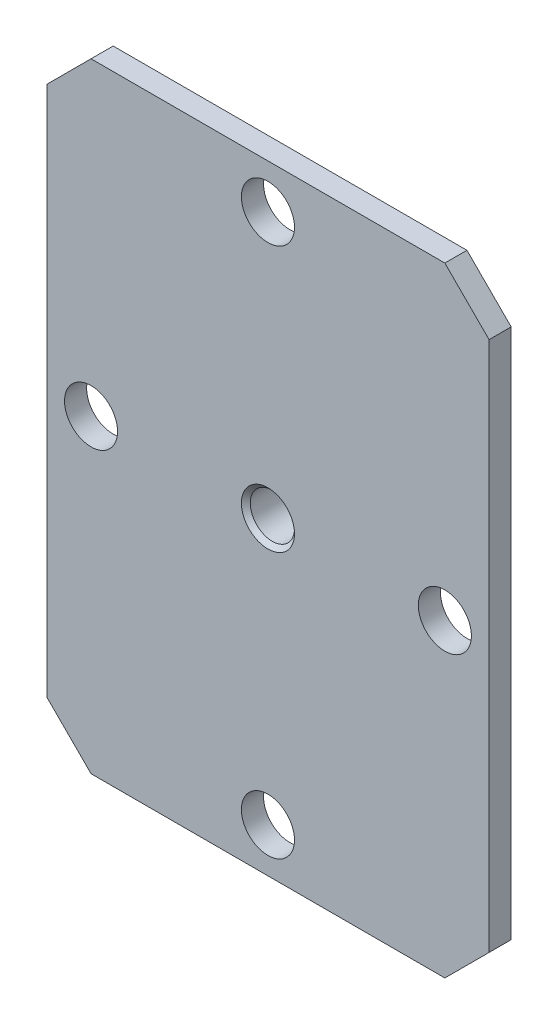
from build123d import *

# Parameters (mm, degrees)
SKETCH1_W          = 100
SKETCH1_H          = 140
EXTRUDE1_DEPTH     = 5
CUT_EXTRUDE1_REACH = 88.168
SKETCH2_R          = 6
CHAMFER1_SIZE      = 10
EXTRUDE2_START     = -5
SKETCH3_W          = 20
SKETCH3_H          = 20
EXTRUDE2_DEPTH     = 7
CUT_EXTRUDE2_REACH = 88.856
SKETCH4_R          = 5
CHAMFER2_SIZE      = 1


with BuildPart() as part:
    # Sketch1 → Extrude1 (new body)
    with BuildSketch(Plane.XY):
        Rectangle(SKETCH1_W, SKETCH1_H)
    extrude(amount=EXTRUDE1_DEPTH)

    # Sketch2 → Cut-Extrude1 (cut, up to next)
    with BuildSketch(Plane.XY.offset(5), mode=Mode.PRIVATE) as cut_extrude1_sk1:
        with Locations((0, 60)):
            Circle(SKETCH2_R)
    cut_extrude1_tool1 = extrude(cut_extrude1_sk1.sketch, amount=-CUT_EXTRUDE1_REACH, mode=Mode.PRIVATE) & part.part
    # Sketch2 → Cut-Extrude1 (cut, up to next)
    with BuildSketch(Plane.XY.offset(5), mode=Mode.PRIVATE) as cut_extrude1_sk2:
        with Locations((40, 0)):
            Circle(SKETCH2_R)
    cut_extrude1_tool2 = extrude(cut_extrude1_sk2.sketch, amount=-CUT_EXTRUDE1_REACH, mode=Mode.PRIVATE) & part.part
    # Sketch2 → Cut-Extrude1 (cut, up to next)
    with BuildSketch(Plane.XY.offset(5), mode=Mode.PRIVATE) as cut_extrude1_sk3:
        with Locations((0, -60)):
            Circle(SKETCH2_R)
    cut_extrude1_tool3 = extrude(cut_extrude1_sk3.sketch, amount=-CUT_EXTRUDE1_REACH, mode=Mode.PRIVATE) & part.part
    # Sketch2 → Cut-Extrude1 (cut, up to next)
    with BuildSketch(Plane.XY.offset(5), mode=Mode.PRIVATE) as cut_extrude1_sk4:
        with Locations((-40, 0)):
            Circle(SKETCH2_R)
    cut_extrude1_tool4 = extrude(cut_extrude1_sk4.sketch, amount=-CUT_EXTRUDE1_REACH, mode=Mode.PRIVATE) & part.part
    add(cut_extrude1_tool1.solids().sort_by_distance((0, 60, 5))[0], mode=Mode.SUBTRACT)
    add(cut_extrude1_tool2.solids().sort_by_distance((40, 0, 5))[0], mode=Mode.SUBTRACT)
    add(cut_extrude1_tool3.solids().sort_by_distance((0, -60, 5))[0], mode=Mode.SUBTRACT)
    add(cut_extrude1_tool4.solids().sort_by_distance((-40, 0, 5))[0], mode=Mode.SUBTRACT)

    # Chamfer1
    chamfer1_edges = [part.edges().sort_by_distance(p)[0] for p in [
        (50, 70, 2.5),
        (50, -70, 2.5),
        (-50, -70, 2.5),
        (-50, 70, 2.5),
    ]]
    chamfer(chamfer1_edges, length=CHAMFER1_SIZE)

    # Sketch3 → Extrude2 (add)
    with BuildSketch(Plane.XY.offset(5).offset(EXTRUDE2_START)):
        Rectangle(SKETCH3_W, SKETCH3_H)
    extrude(amount=-EXTRUDE2_DEPTH)

    # Sketch4 → Cut-Extrude2 (cut, up to next)
    with BuildSketch(Plane.XY.offset(5), mode=Mode.PRIVATE) as cut_extrude2_sk1:
        Circle(SKETCH4_R)
    cut_extrude2_tool1 = extrude(cut_extrude2_sk1.sketch, amount=-CUT_EXTRUDE2_REACH, mode=Mode.PRIVATE) & part.part
    add(cut_extrude2_tool1.solids().sort_by_distance((0, 0, 5))[0], mode=Mode.SUBTRACT)

    # Chamfer2
    chamfer2_edges = [part.edges().sort_by_distance(p)[0] for p in [
        (-5, 0, 5),
    ]]
    chamfer(chamfer2_edges, length=CHAMFER2_SIZE)


solid = part.part
